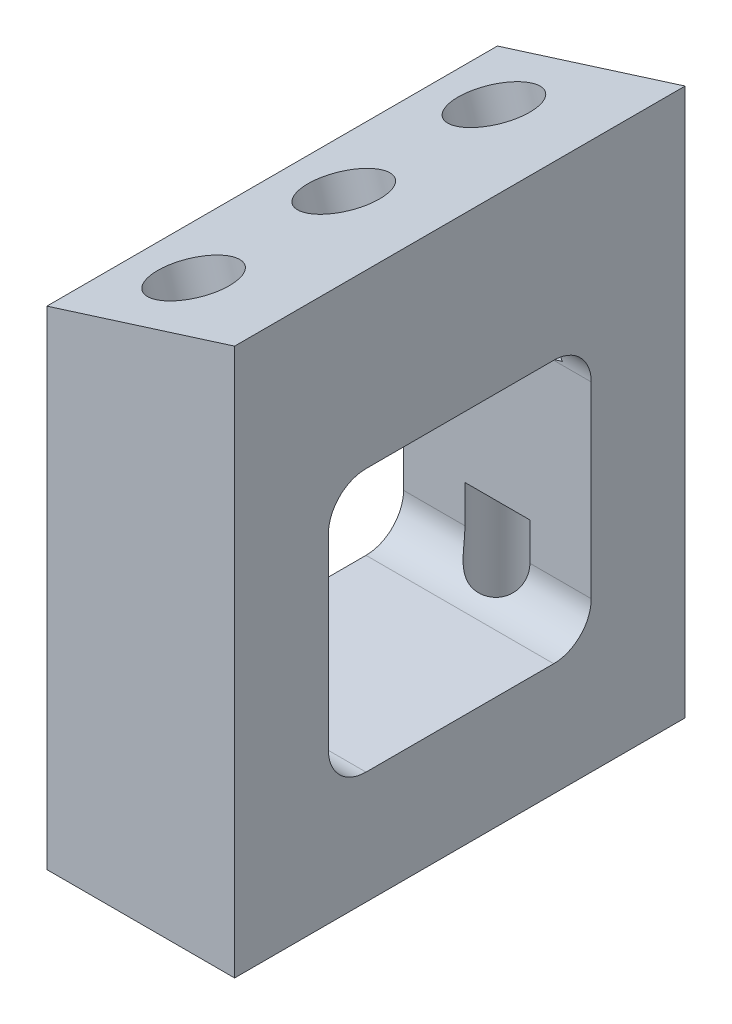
from build123d import *

# Parameters (mm, degrees)
BOSS_EXTRUDE1_DEPTH = 19.05
SKETCH5_W           = 22.225
SKETCH5_H           = 22.225
CUT_EXTRUDE3_DEPTH  = 19.05
FILLET1_R           = 3.175
SKETCH3_R           = 3.175
CUT_EXTRUDE1_DEPTH  = 15.875
SKETCH4_R           = 3.175
CUT_EXTRUDE2_DEPTH  = 15.875


with BuildPart() as part:
    # Sketch2 → Boss-Extrude1 (new, symmetric)
    with BuildSketch(Plane.XY):
        Polygon((0, 0), (7.9375, 0), (7.9375, 46.280368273), (-7.9375, 41.275), (-7.9375, 0), align=None)
    extrude(amount=BOSS_EXTRUDE1_DEPTH, both=True)

    # Sketch5 → Cut-Extrude3 (cut, symmetric)
    with BuildSketch(Plane(origin=(0, 0, 0), x_dir=(0, 0, -1), z_dir=(1, 0, 0))):
        with Locations((0, 20.6375)):
            Rectangle(SKETCH5_W, SKETCH5_H)
    extrude(amount=CUT_EXTRUDE3_DEPTH, both=True, mode=Mode.SUBTRACT)

    # Fillet1
    fillet1_edges = [part.edges().sort_by_distance(p)[0] for p in [
        (0, 9.525, 11.1125),
        (0, 31.75, 11.1125),
        (0, 31.75, -11.1125),
        (0, 9.525, -11.1125),
    ]]
    fillet(fillet1_edges, radius=FILLET1_R)

    # Sketch3 → Cut-Extrude1 (cut)
    with BuildSketch(Plane(origin=(-12.554924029, 39.819131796, 0), x_dir=(0.9537169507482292, 0.30070579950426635, 0), z_dir=(-0.30070579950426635, 0.9537169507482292, 0))):
        with Locations(Location((11.191503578, 0, 0), (0, 0, 180))):
            Circle(SKETCH3_R)
        with Locations(Location((11.191503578, -12.7, 0), (0, 0, 180))):
            Circle(SKETCH3_R)
        with Locations(Location((11.191503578, 12.7, 0), (0, 0, 180))):
            Circle(SKETCH3_R)
    extrude(amount=-CUT_EXTRUDE1_DEPTH, mode=Mode.SUBTRACT)

    # Sketch4 → Cut-Extrude2 (cut)
    with BuildSketch(Plane.XZ):
        with Locations(Location((0, 12.7, 0), (0, 0, 270))):
            Circle(SKETCH4_R)
        with Locations(Location((0, -12.7, 0), (0, 0, 270))):
            Circle(SKETCH4_R)
    extrude(amount=-CUT_EXTRUDE2_DEPTH, mode=Mode.SUBTRACT)


solid = part.part
